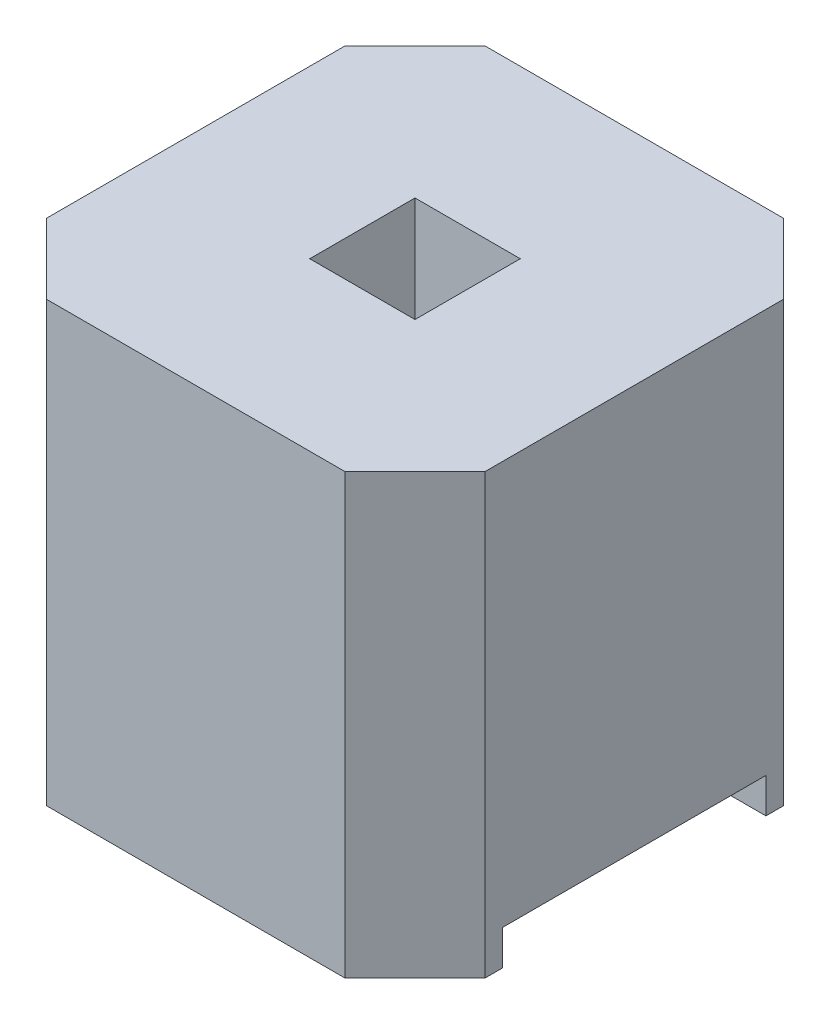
from build123d import *

# Parameters (mm, degrees)
ESQUISSE1_W             = 0.6
ESQUISSE1_H             = 0.6
BOSS_EXTRU_1_DEPTH      = 2.5
ESQUISSE2_W             = 1.5
ESQUISSE2_H             = 0.4
ENL_V_MAT_EXTRU_1_DEPTH = 4.75


with BuildPart() as part:
    # Esquisse1 → Boss.-Extru.1 (new body)
    with BuildSketch(Plane(origin=(0, 0, 0), x_dir=(1, 0, 0), z_dir=(0, 1, 0))):
        Polygon((-1.25, 0.85), (-0.85, 1.25), (0.85, 1.25), (1.25, 0.85), (1.25, -0.85), (0.85, -1.25), (-0.85, -1.25), (-1.25, -0.85), align=None)
        Rectangle(ESQUISSE1_W, ESQUISSE1_H, mode=Mode.SUBTRACT)
    extrude(amount=BOSS_EXTRU_1_DEPTH)

    # Esquisse2 → Enl_v. mat.-Extru.1 (cut, through all)
    with BuildSketch(Plane.ZY.offset(1.25)):
        Rectangle(ESQUISSE2_W, ESQUISSE2_H)
    extrude(amount=-ENL_V_MAT_EXTRU_1_DEPTH, mode=Mode.SUBTRACT)


solid = part.part
